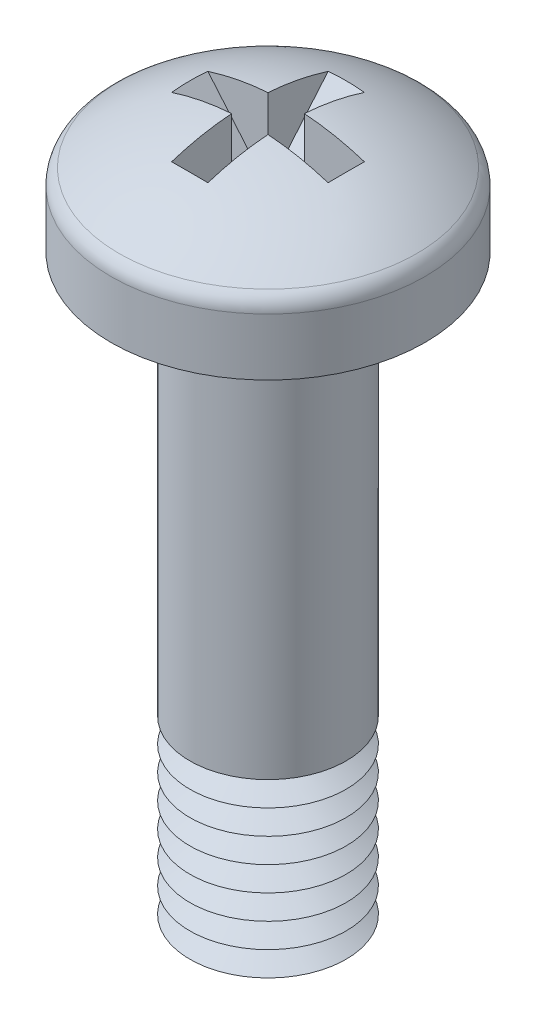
from build123d import *

# Parameters (mm, degrees)
CUT_EXTRUDE1_DEPTH = 0.465
CUT_EXTRUDE2_DEPTH = 0.465


with BuildPart() as part:
    # Sketch1 → Base-Revolve (revolve)
    with BuildSketch(Plane.XY, mode=Mode.PRIVATE) as base_revolve_sk:
        with BuildLine():
            Line((0, 0), (4.020794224, 0))
            Line((4.020794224, 0), (4.020794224, 1.462851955))
            ThreePointArc((4.020794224, 1.462851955), (3.965779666, 1.691052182), (3.812823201, 1.869114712))
            ThreePointArc((3.812823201, 1.869114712), (2.003291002, 2.784653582), (0, 3.1))
            Line((0, 3.1), (0, 0))
        make_face()
    revolve(base_revolve_sk.sketch.rotate(Axis((0, 0, 0), (0, 1, 0)), 90), axis=Axis((0, 0, 0), (0, 1, 0)))

    # Sketch2 → Boss-Revolve1 (revolve)
    with BuildSketch(Plane.XY, mode=Mode.PRIVATE) as boss_revolve1_sk:
        Polygon((0, -15), (1.45595, -15), (2, -14.685892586), (1.45595, -14.371785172), (2, -14.057677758), (1.45595, -13.743570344), (2, -13.42946293), (1.45595, -13.115355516), (2, -12.801248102), (1.45595, -12.487140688), (2, -12.173033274), (1.45595, -11.85892586), (2, -11.544818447), (1.45595, -11.230711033), (2, -10.916603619), (1.45595, -10.602496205), (2, -10.288388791), (2, 0), (0, 0), align=None)
    revolve(boss_revolve1_sk.sketch.rotate(Axis((0, 0, 0), (0, 1, 0)), 90), axis=Axis((0, 0, 0), (0, 1, 0)))

    # Sketch3 → Cut-Extrude1 (cut, symmetric)
    with BuildSketch(Plane.XY):
        Polygon((-2.285, 4.65), (2.285, 4.65), (2.285, 3.1), (0, 0.4), (-2.285, 3.1), align=None)
    extrude(amount=CUT_EXTRUDE1_DEPTH, both=True, mode=Mode.SUBTRACT)

    # Sketch4 → Cut-Extrude2 (cut, symmetric)
    with BuildSketch(Plane(origin=(0, 0, 0), x_dir=(0, 0, -1), z_dir=(1, 0, 0))):
        Polygon((-2.285, 4.65), (2.285, 4.65), (2.285, 3.1), (0, 0.4), (-2.285, 3.1), align=None)
    extrude(amount=CUT_EXTRUDE2_DEPTH, both=True, mode=Mode.SUBTRACT)


solid = part.part
